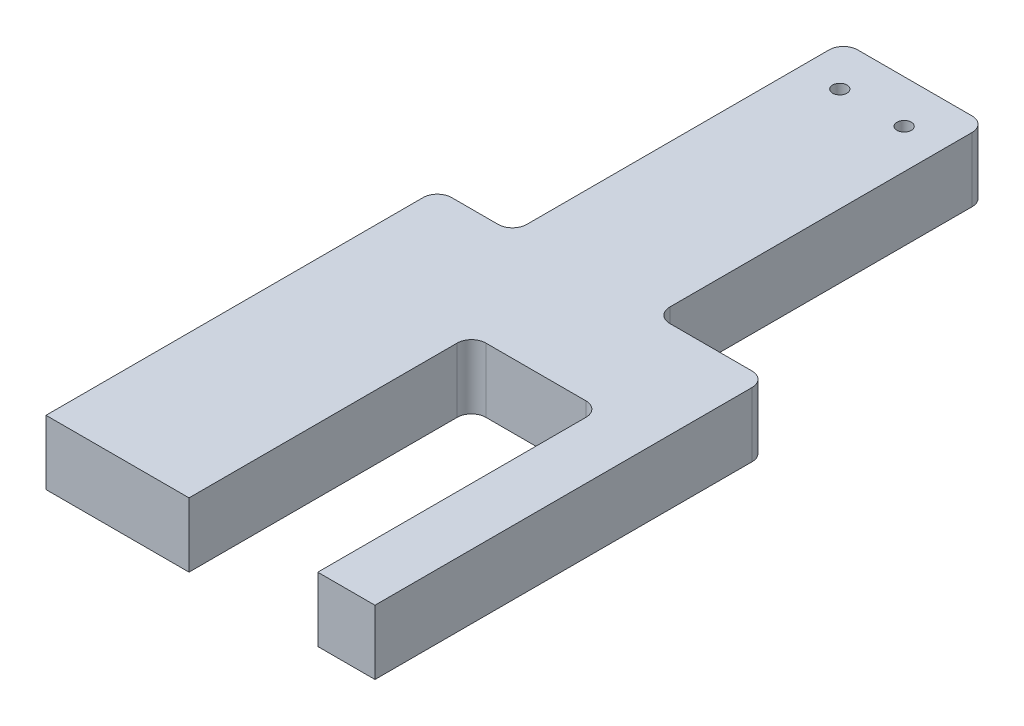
from build123d import *

# Parameters (mm, degrees)
SKETCH1_R           = 1
BOSS_EXTRUDE1_DEPTH = 9
FILLET3_R           = 2


with BuildPart() as part:
    # Sketch1 → Boss-Extrude1 (new body)
    with BuildSketch(Plane(origin=(0, 0, 0), x_dir=(1, 0, 0), z_dir=(0, 1, 0))):
        Polygon((-9, 0), (-9, -39.5), (-29, -39.5), (-29, 15.227595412), (-18.5, 15.227595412), (-18.5, 61.5), (1.5, 61.5), (1.5, 15.227595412), (17, 15.227595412), (17, -39.5), (9, -39.5), (9, 0), align=None)
        with Locations(Location((-13, 55.5, 0), (0, 0, 270))):
            Circle(SKETCH1_R, mode=Mode.SUBTRACT)
        with Locations(Location((-4, 55.5, 0), (0, 0, 270))):
            Circle(SKETCH1_R, mode=Mode.SUBTRACT)
    extrude(amount=BOSS_EXTRUDE1_DEPTH)

    # Fillet3
    fillet3_edges = [part.edges().sort_by_distance(p)[0] for p in [
        (9, 4.5, 0),
        (-9, 4.5, 0),
        (-29, 4.5, -15.227595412),
        (-18.5, 4.5, -15.227595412),
        (-18.5, 4.5, -61.5),
        (1.5, 4.5, -61.5),
        (1.5, 4.5, -15.227595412),
        (17, 4.5, -15.227595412),
    ]]
    fillet(fillet3_edges, radius=FILLET3_R)


solid = part.part
